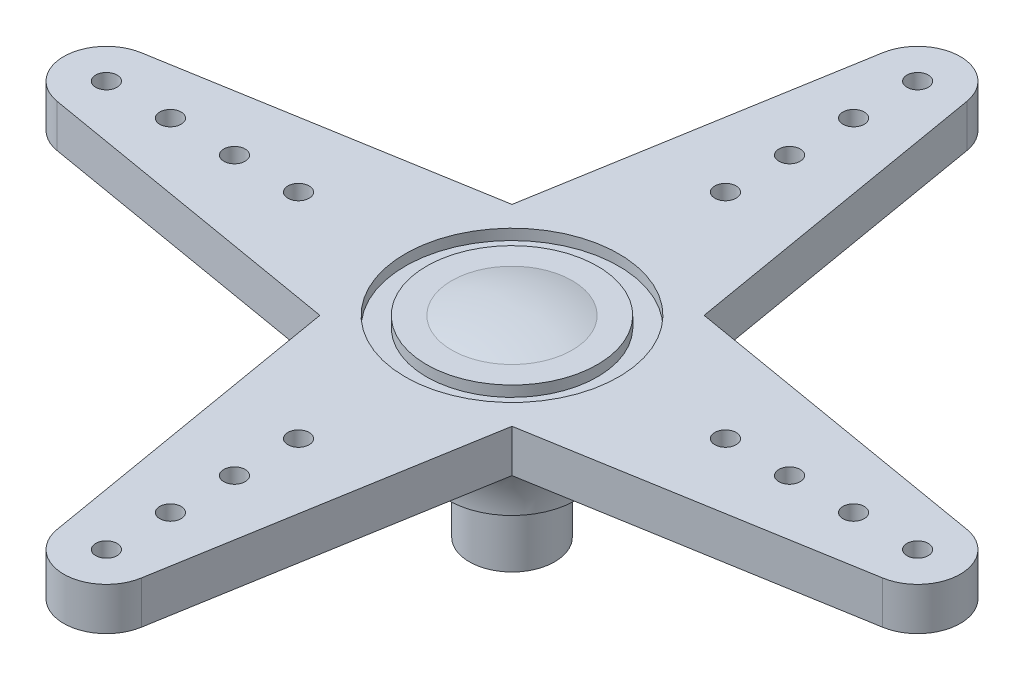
from build123d import *

# Parameters (mm, degrees)
ESQUISSE2_R                  = 0.5
EXTRUSION1_DEPTH             = 2
R_P_TITION_CIRCULAIRE1_COUNT = 4
ESQUISSE3_R                  = 5
ESQUISSE3_R_2                = 4
ENL_V_MAT_EXTRU_1_DEPTH      = 0.5


with BuildPart() as part:
    # Esquisse1 → R_volution1 (revolve)
    with BuildSketch(Plane.XY, mode=Mode.PRIVATE) as r_volution1_sk:
        with BuildLine():
            Line((0, 0), (-2, 0))
            Line((-2, 0), (-2, 3))
            Line((-2, 3), (-3, 3))
            ThreePointArc((-3, 3), (-3.25658351, 4.58113883), (-4, 6))
            Line((-4, 6), (-4, 7))
            Line((-4, 7), (0, 7))
            Line((0, 7), (0, 0))
        make_face()
    revolve(r_volution1_sk.sketch.rotate(Axis((0, 0, 0), (0, 1, 0)), 270), axis=Axis((0, 0, 0), (0, 1, 0)))

    # Esquisse2 → Extrusion1 (add)
    with BuildSketch(Plane(origin=(0, 7, 0), x_dir=(-1, 0, 0), z_dir=(0, 1, 0))):
        with BuildLine():
            Line((0, 0), (-4.5, -4.5))
            Line((-4.5, -4.5), (-19.336005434, -1.971573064))
            ThreePointArc((-19.336005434, -1.971573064), (-21, 0), (-19.336005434, 1.971573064))
            Line((-19.336005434, 1.971573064), (-4.5, 4.5))
            Line((-4.5, 4.5), (0, 0))
        make_face()
        with Locations(Location((-19, 0, 0), (0, 0, 90))):
            Circle(ESQUISSE2_R, mode=Mode.SUBTRACT)
        with Locations(Location((-16, 0, 0), (0, 0, 90))):
            Circle(ESQUISSE2_R, mode=Mode.SUBTRACT)
        with Locations(Location((-13, 0, 0), (0, 0, 90))):
            Circle(ESQUISSE2_R, mode=Mode.SUBTRACT)
        with Locations(Location((-10, 0, 0), (0, 0, 90))):
            Circle(ESQUISSE2_R, mode=Mode.SUBTRACT)
    extrusion1 = extrude(amount=EXTRUSION1_DEPTH)

    # R_p_tition circulaire1: Extrusion1 ×4 about axis
    r_p_tition_circulaire1_axis = Axis((0, 0, 0), (0, 1, 0))
    for i in range(1, R_P_TITION_CIRCULAIRE1_COUNT):
        add(extrusion1.rotate(r_p_tition_circulaire1_axis, i * 360 / R_P_TITION_CIRCULAIRE1_COUNT))

    # Esquisse3 → Enl_v. mat.-Extru.1 (cut)
    with BuildSketch(Plane(origin=(0, 9, 0), x_dir=(-1, 0, 0), z_dir=(0, 1, 0))):
        with Locations(Location((0, 0, 0), (0, 0, 90))):
            Circle(ESQUISSE3_R)
        with Locations(Location((0, 0, 0), (0, 0, 270))):
            Circle(ESQUISSE3_R_2, mode=Mode.SUBTRACT)
    extrude(amount=-ENL_V_MAT_EXTRU_1_DEPTH, mode=Mode.SUBTRACT)

    # Esquisse4 → R_volution2 (revolve)
    with BuildSketch(Plane.XY, mode=Mode.PRIVATE) as r_volution2_sk:
        with BuildLine():
            Line((-2.821682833, 9), (0, 9))
            Line((0, 9), (0, 9.398502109))
            ThreePointArc((0, 9.398502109), (-1.424841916, 9.298384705), (-2.821682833, 9))
        make_face()
    revolve(r_volution2_sk.sketch.rotate(Axis((0, -26.712253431, 0), (0, 1, 0)), 90), axis=Axis((0, -26.712253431, 0), (0, 1, 0)))


solid = part.part
